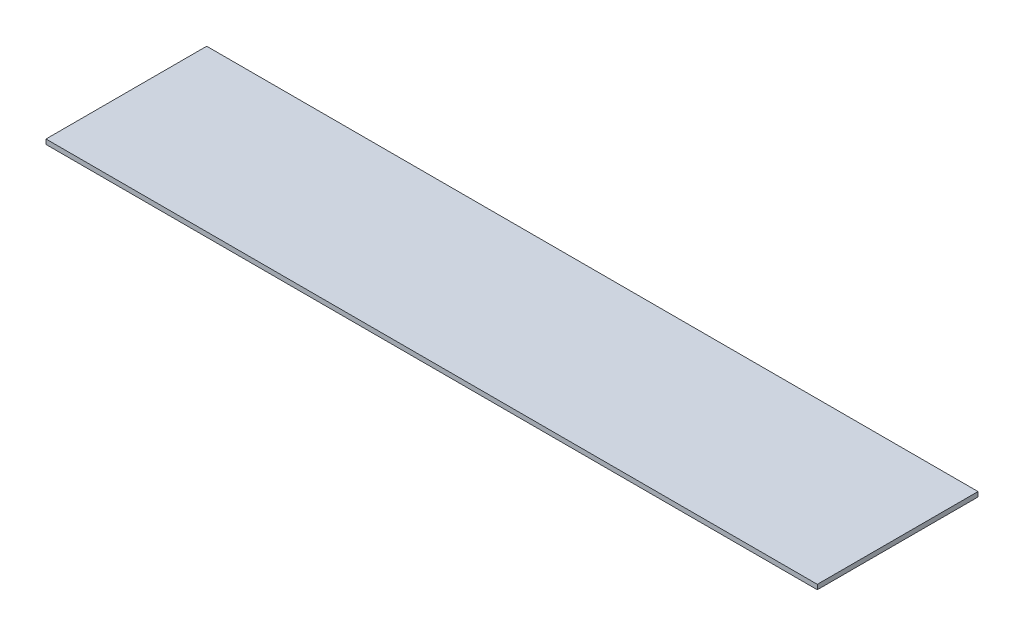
from build123d import *

# Parameters (mm, degrees)
SKETCH1_W           = 487.68
SKETCH1_H           = 101.6
BOSS_EXTRUDE1_DEPTH = 3


with BuildPart() as part:
    # Sketch1 → Boss-Extrude1 (new body)
    with BuildSketch(Plane(origin=(0, 0, 0), x_dir=(1, 0, 0), z_dir=(0, 1, 0))):
        with Locations((243.84, 50.8)):
            Rectangle(SKETCH1_W, SKETCH1_H)
    extrude(amount=BOSS_EXTRUDE1_DEPTH)


solid = part.part
